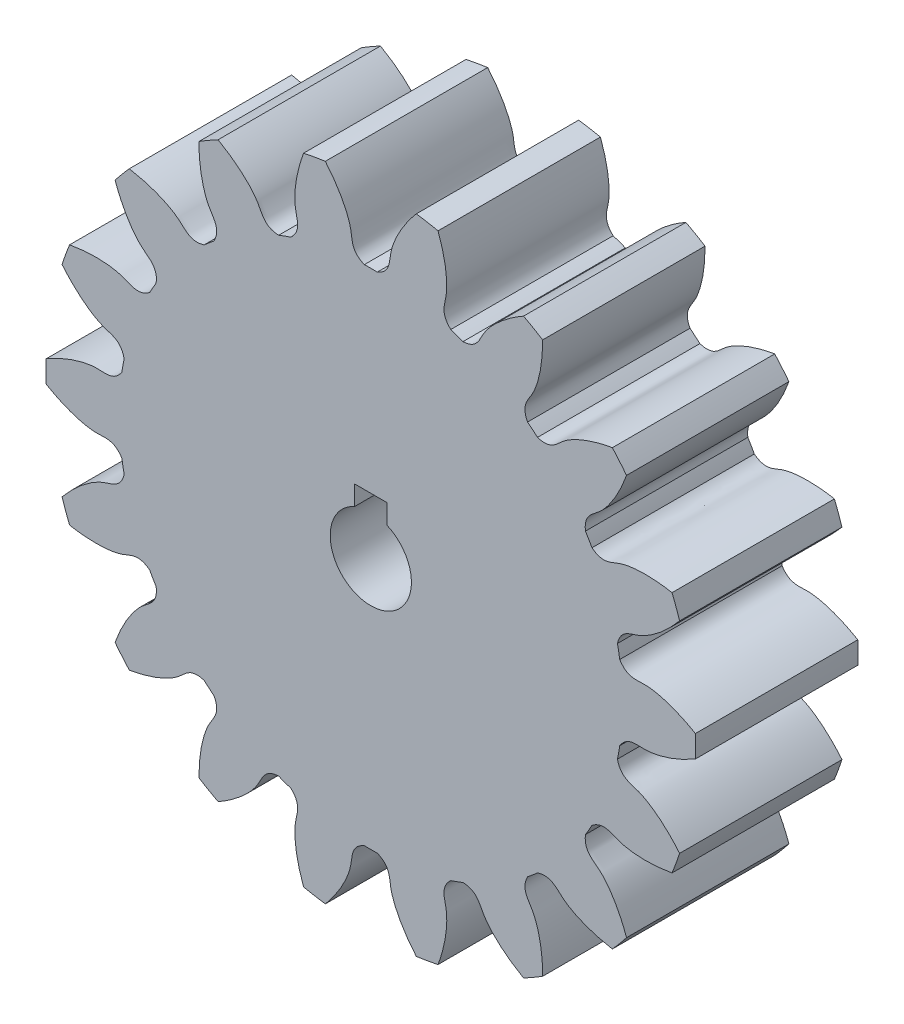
from build123d import *

# Parameters (mm, degrees)
SKETCH_1_R               = 20
EXTRUDE_1_DEPTH          = 10
CUT_EXTRUDE_1_DEPTH      = 31
PATTERN_CIRCULAR_1_COUNT = 18
SKETCH_4_R               = 2.5
CUT_EXTRUDE_2_DEPTH      = 10
SKETCH_11_W              = 2
SKETCH_11_H              = 2
CUT_EXTRUDE_3_DEPTH      = 10


with BuildPart() as part:
    # Sketch 1 → Extrude 1 (new body)
    with BuildSketch(Plane.XY):
        Circle(SKETCH_1_R)
    extrude(amount=EXTRUDE_1_DEPTH)

    # Sketch 2 → Cut-Extrude 1 (cut, through all)
    with BuildSketch(Plane.XY):
        with BuildLine():
            ThreePointArc((0.398807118, 15.494868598), (0, 15.5), (-0.398807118, 15.494868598))
            add(Edge.make_bspline(
                [(-0.398807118, 15.494868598), (-1.23020808, 15.837360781), (-1.1255781, 16.477399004), (-1.263665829, 17.085190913), (-1.27750304, 17.141013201), (-1.294215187, 17.203080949), (-1.314049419, 17.271300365), (-1.337260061, 17.345568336), (-1.364095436, 17.425774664), (-1.394801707, 17.511801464), (-1.429621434, 17.603523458), (-1.46879375, 17.700807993), (-1.512554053, 17.803515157), (-1.561133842, 17.911497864), (-1.614760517, 18.02460196), (-1.673657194, 18.142666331), (-1.738042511, 18.265523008), (-1.80813045, 18.392997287), (-1.884130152, 18.524907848), (-1.96624574, 18.661066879), (-2.054676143, 18.801280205), (-2.149614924, 18.945347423), (-2.25125011, 19.09306204), (-2.359764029, 19.244211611), (-2.475333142, 19.398577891), (-2.598127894, 19.555936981), (-2.728312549, 19.716059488), (-2.866045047, 19.878710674), (-3.011476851, 20.043650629), (-3.164752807, 20.210634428), (-3.326011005, 20.379412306), (-3.495382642, 20.549729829), (-3.672991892, 20.72132807), (-3.858955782, 20.893943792), (-4.053384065, 21.067309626), (-4.256379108, 21.241154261), (-4.468035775, 21.415202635), (-4.68844132, 21.58917612), (-4.917675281, 21.762792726), (-5.155809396, 21.935767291), (-5.402907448, 22.107811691), (-5.748150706, 22.338079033), (-6.015110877, 22.504667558), (-6.197121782, 22.613356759)],
                knots=[0, 0, 0, 0, 0.187591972, 0.192996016, 0.1991206, 0.205965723, 0.213531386, 0.221817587, 0.230824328, 0.240551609, 0.250999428, 0.262167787, 0.274056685, 0.286666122, 0.299996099, 0.314046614, 0.32881767, 0.344309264, 0.360521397, 0.37745407, 0.395107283, 0.413481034, 0.432575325, 0.452390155, 0.472925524, 0.494181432, 0.51615788, 0.538854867, 0.562272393, 0.586410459, 0.611269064, 0.636848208, 0.663147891, 0.690168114, 0.717908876, 0.746370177, 0.775552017, 0.805454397, 0.836077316, 0.867420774, 0.899484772, 0.932269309, 1, 1, 1, 1], degree=3))
            ThreePointArc((-6.197121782, 22.613356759), (0, 23.447136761), (6.197121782, 22.613356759))
            add(Edge.make_bspline(
                [(0.398807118, 15.494868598), (1.23020808, 15.837360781), (1.1255781, 16.477399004), (1.263665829, 17.085190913), (1.27750304, 17.141013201), (1.294215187, 17.203080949), (1.314049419, 17.271300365), (1.337260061, 17.345568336), (1.364095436, 17.425774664), (1.394801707, 17.511801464), (1.429621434, 17.603523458), (1.46879375, 17.700807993), (1.512554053, 17.803515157), (1.561133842, 17.911497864), (1.614760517, 18.02460196), (1.673657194, 18.142666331), (1.738042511, 18.265523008), (1.80813045, 18.392997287), (1.884130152, 18.524907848), (1.96624574, 18.661066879), (2.054676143, 18.801280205), (2.149614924, 18.945347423), (2.25125011, 19.09306204), (2.359764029, 19.244211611), (2.475333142, 19.398577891), (2.598127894, 19.555936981), (2.728312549, 19.716059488), (2.866045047, 19.878710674), (3.011476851, 20.043650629), (3.164752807, 20.210634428), (3.326011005, 20.379412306), (3.495382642, 20.549729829), (3.672991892, 20.72132807), (3.858955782, 20.893943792), (4.053384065, 21.067309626), (4.256379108, 21.241154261), (4.468035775, 21.415202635), (4.68844132, 21.58917612), (4.917675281, 21.762792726), (5.155809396, 21.935767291), (5.402907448, 22.107811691), (5.748150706, 22.338079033), (6.015110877, 22.504667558), (6.197121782, 22.613356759)],
                knots=[0, 0, 0, 0, 0.187591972, 0.192996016, 0.1991206, 0.205965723, 0.213531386, 0.221817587, 0.230824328, 0.240551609, 0.250999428, 0.262167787, 0.274056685, 0.286666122, 0.299996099, 0.314046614, 0.32881767, 0.344309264, 0.360521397, 0.37745407, 0.395107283, 0.413481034, 0.432575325, 0.452390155, 0.472925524, 0.494181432, 0.51615788, 0.538854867, 0.562272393, 0.586410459, 0.611269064, 0.636848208, 0.663147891, 0.690168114, 0.717908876, 0.746370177, 0.775552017, 0.805454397, 0.836077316, 0.867420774, 0.899484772, 0.932269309, 1, 1, 1, 1], degree=3))
        make_face()
    cut_extrude_1 = extrude(amount=CUT_EXTRUDE_1_DEPTH, mode=Mode.SUBTRACT)

    # Pattern Circular 1: Cut-Extrude 1 ×18 about axis
    pattern_circular_1_axis = Axis((0, 0, 10), (0, 0, -1))
    for i in range(1, PATTERN_CIRCULAR_1_COUNT):
        add(cut_extrude_1.rotate(pattern_circular_1_axis, i * 360 / PATTERN_CIRCULAR_1_COUNT), mode=Mode.SUBTRACT)

    # Sketch 4 → Cut-Extrude 2 (cut)
    with BuildSketch(Plane.XY.offset(10)):
        Circle(SKETCH_4_R)
    extrude(amount=-CUT_EXTRUDE_2_DEPTH, mode=Mode.SUBTRACT)

    # Sketch 11 → Cut-Extrude 3 (cut)
    with BuildSketch(Plane(origin=(0, 0, 0), x_dir=(-1, 0, 0), z_dir=(0, 0, -1))):
        with Locations((0, 2.5)):
            Rectangle(SKETCH_11_W, SKETCH_11_H)
    extrude(amount=-CUT_EXTRUDE_3_DEPTH, mode=Mode.SUBTRACT)


solid = part.part
